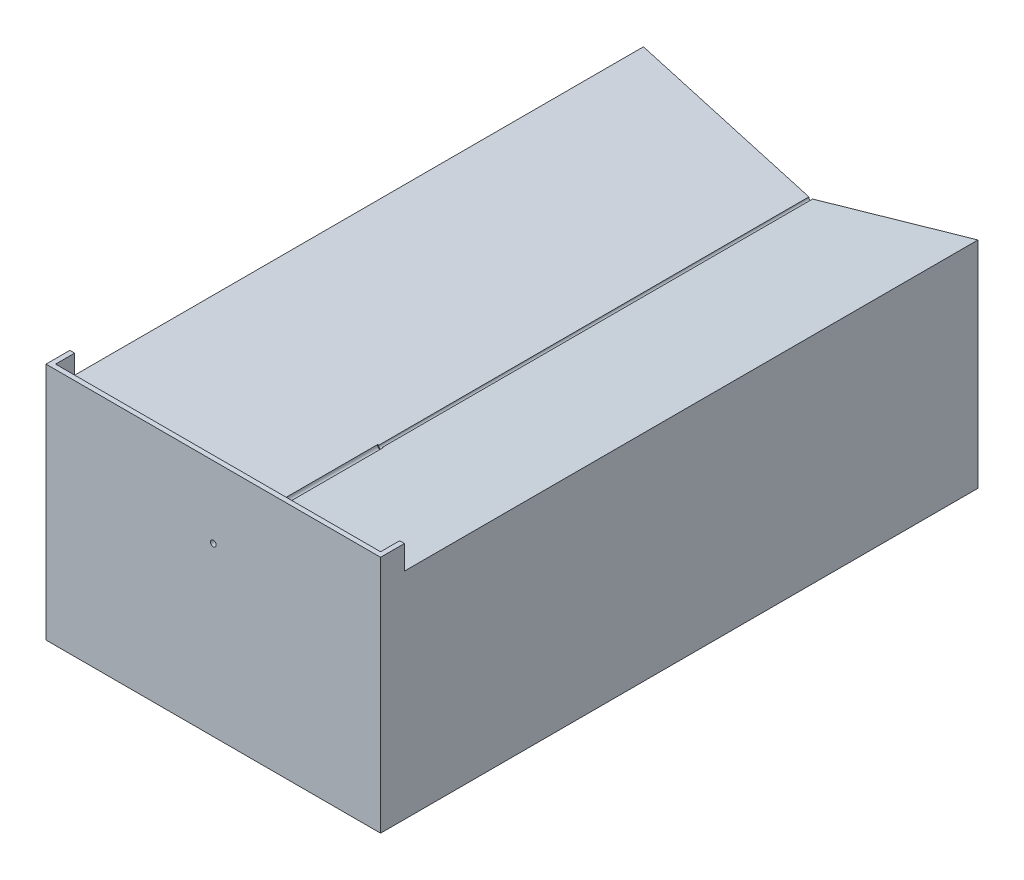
from build123d import *

# Parameters (mm, degrees)
RESSALTO_EXTRUS_O2_DEPTH = 120
ESBO_O2_W                = 70
ESBO_O2_H                = 50
RESSALTO_EXTRUS_O3_DEPTH = 5
ESBO_O3_W                = 68
ESBO_O3_H                = 4
CORTE_EXTRUS_O1_DEPTH    = 48
ESBO_O5_R                = 0.4
CORTE_EXTRUS_O4_DEPTH    = 127
ESBO_O6_R                = 0.6
CORTE_EXTRUS_O6_DEPTH    = 35


with BuildPart() as part:
    # Esbo_o1 → Ressalto-extrus_o2 (new body)
    with BuildSketch(Plane.XY):
        with BuildLine():
            Line((35, -22.5), (-35, -22.5))
            Line((-35, -22.5), (-35, 22.5))
            Line((-35, 22.5), (-0.384609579, 12.609888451))
            ThreePointArc((-0.384609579, 12.609888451), (0, 12.1), (0.384609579, 12.609888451))
            Line((0.384609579, 12.609888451), (35, 22.5))
            Line((35, 22.5), (35, -22.5))
        make_face()
    extrude(amount=RESSALTO_EXTRUS_O2_DEPTH)

    # Esbo_o2 → Ressalto-extrus_o3 (add)
    with BuildSketch(Plane.XY.offset(120)):
        with Locations((0, 2.5)):
            Rectangle(ESBO_O2_W, ESBO_O2_H)
    extrude(amount=RESSALTO_EXTRUS_O3_DEPTH)

    # Esbo_o3 → Corte-extrus_o1 (cut)
    with BuildSketch(Plane(origin=(0, 27.5, 0), x_dir=(1, 0, 0), z_dir=(0, 1, 0))):
        with Locations((0, -122)):
            Rectangle(ESBO_O3_W, ESBO_O3_H)
    extrude(amount=-CORTE_EXTRUS_O1_DEPTH, mode=Mode.SUBTRACT)

    # Esbo_o5 → Corte-extrus_o4 (cut)
    with BuildSketch(Plane(origin=(0, 0, 0), x_dir=(-1, 0, 0), z_dir=(0, 0, -1))):
        with Locations((0, 12.5)):
            Circle(ESBO_O5_R)
    extrude(amount=-CORTE_EXTRUS_O4_DEPTH, mode=Mode.SUBTRACT)

    # Esbo_o6 → Corte-extrus_o6 (cut)
    with BuildSketch(Plane.XY.offset(125)):
        with Locations((0, 12.5)):
            Circle(ESBO_O6_R)
    extrude(amount=-CORTE_EXTRUS_O6_DEPTH, mode=Mode.SUBTRACT)


solid = part.part
